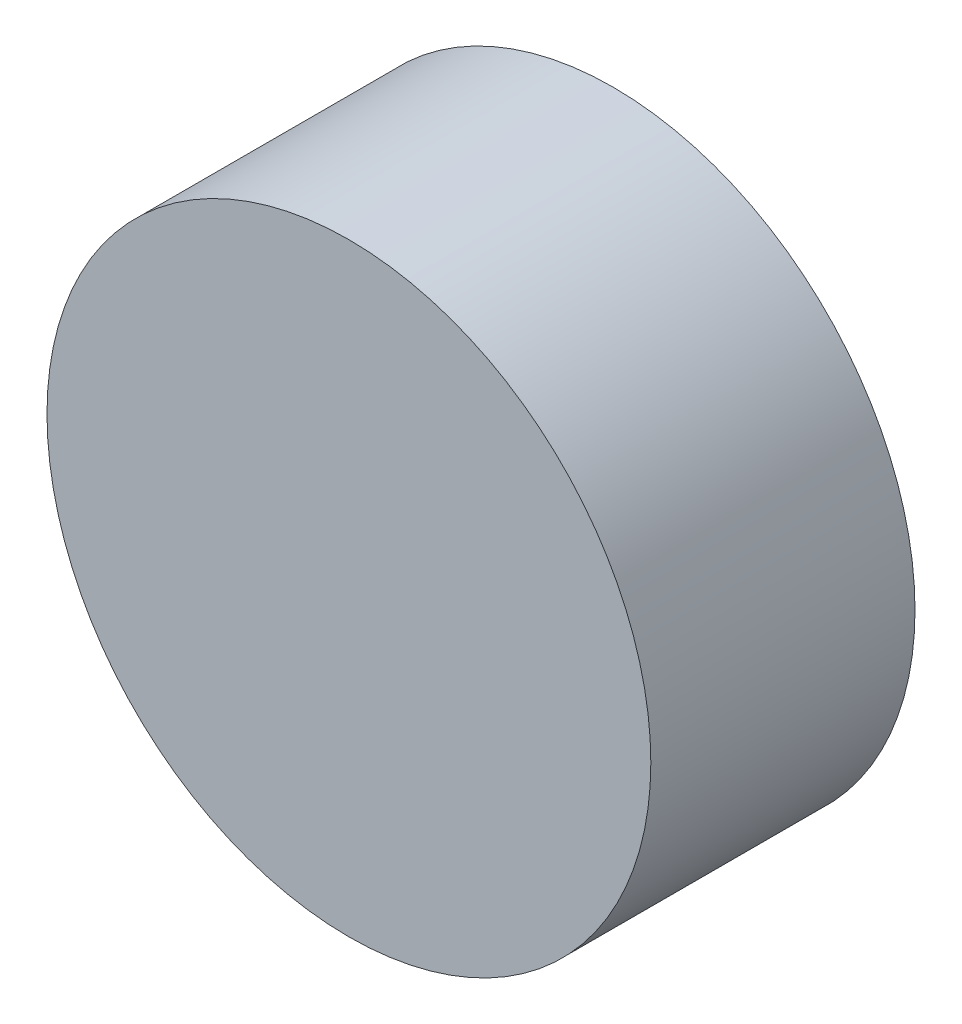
from build123d import *

# Parameters (mm, degrees)
SKETCH_1_R      = 4
EXTRUDE_1_DEPTH = 3.5


with BuildPart() as part:
    # Sketch 1 → Extrude 1 (new body)
    with BuildSketch(Plane.XY):
        Circle(SKETCH_1_R)
    extrude(amount=EXTRUDE_1_DEPTH)


solid = part.part
